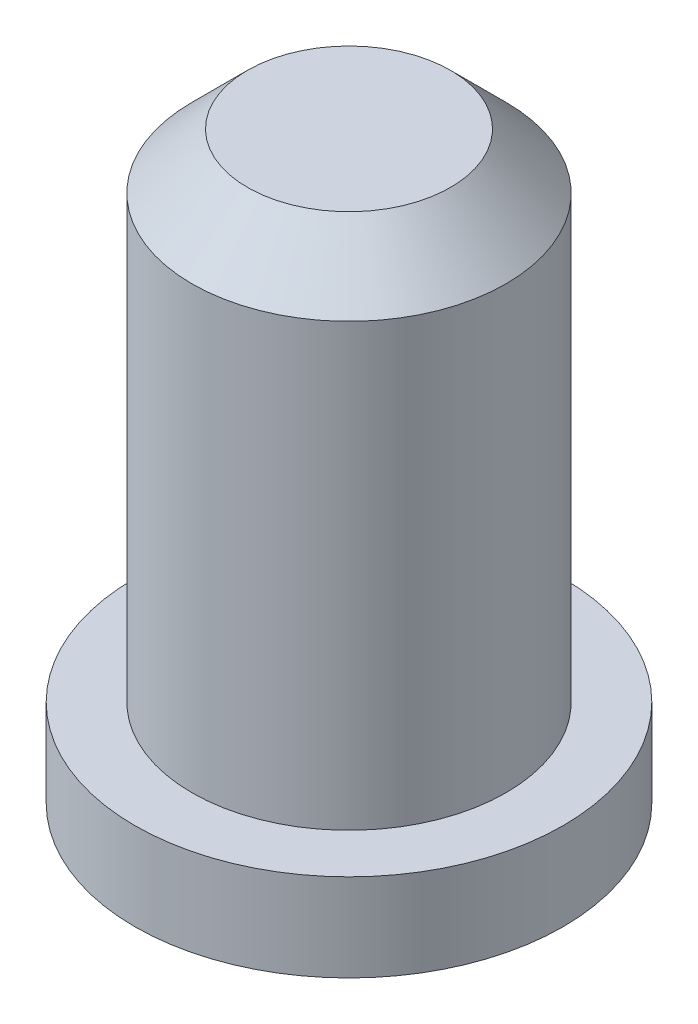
from build123d import *


with BuildPart() as part:
    # Sketch1 → Revolve1 (revolve)
    with BuildSketch(Plane.XY, mode=Mode.PRIVATE) as revolve1_sk:
        Polygon((0, 0), (1.9558, 0), (1.9558, 0.8001), (1.4351, 0.8001), (1.4351, 4.826), (0.9271, 5.334), (0, 5.334), align=None)
    revolve(revolve1_sk.sketch.rotate(Axis((0, 2.667, 0), (0, -1, 0)), 180), axis=Axis((0, 2.667, 0), (0, -1, 0)))


solid = part.part
